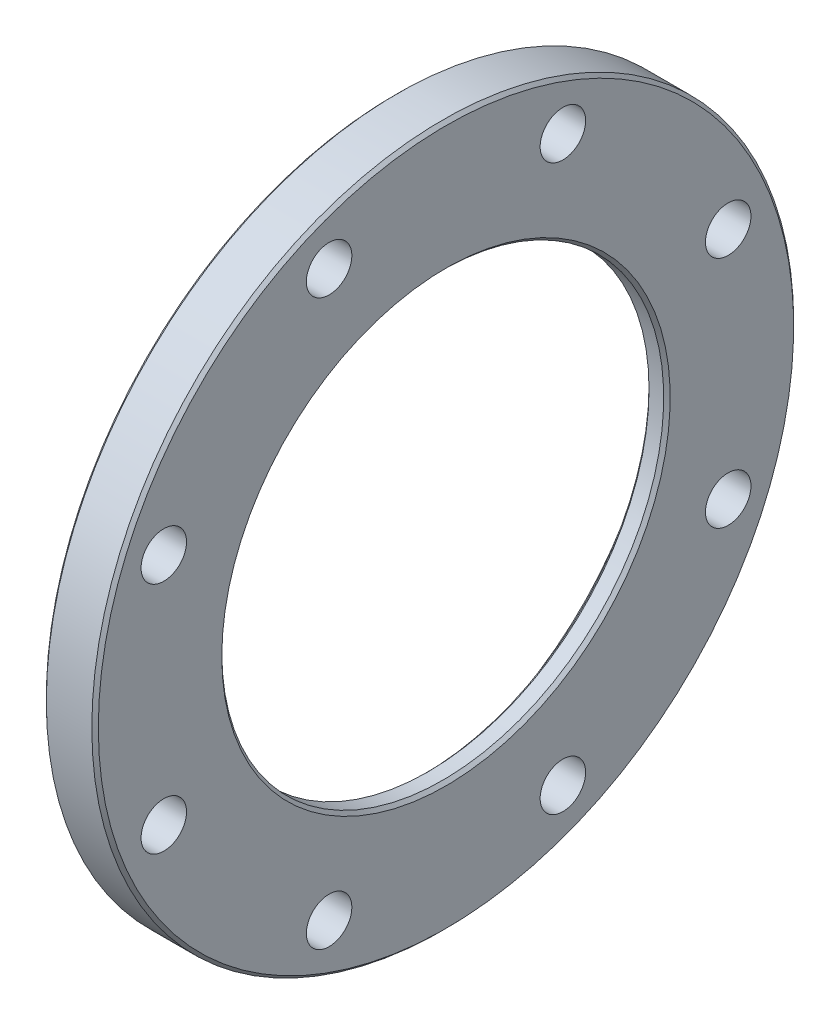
ISO-10303-21;
HEADER;
FILE_DESCRIPTION(('STEP AP214'),'2;1');
FILE_NAME('part.step','',(''),(''),'','','');
FILE_SCHEMA(('AUTOMOTIVE_DESIGN { 1 0 10303 214 1 1 1 1 }'));
ENDSEC;
DATA;
#1=APPLICATION_CONTEXT('core data for automotive mechanical design processes');
#2=APPLICATION_PROTOCOL_DEFINITION('international standard','automotive_design',2000,#1);
#3=PRODUCT_CONTEXT('',#1,'mechanical');
#4=PRODUCT('Part','Part','',(#3));
#5=PRODUCT_RELATED_PRODUCT_CATEGORY('part','',(#4));
#6=PRODUCT_DEFINITION_FORMATION('','',#4);
#7=PRODUCT_DEFINITION_CONTEXT('part definition',#1,'design');
#8=PRODUCT_DEFINITION('design','',#6,#7);
#9=PRODUCT_DEFINITION_SHAPE('','',#8);
#10=(LENGTH_UNIT() NAMED_UNIT(*) SI_UNIT(.MILLI.,.METRE.));
#11=(NAMED_UNIT(*) PLANE_ANGLE_UNIT() SI_UNIT($,.RADIAN.));
#12=(NAMED_UNIT(*) SI_UNIT($,.STERADIAN.) SOLID_ANGLE_UNIT());
#13=UNCERTAINTY_MEASURE_WITH_UNIT(LENGTH_MEASURE(1.E-05),#10,'distance_accuracy_value','');
#14=(GEOMETRIC_REPRESENTATION_CONTEXT(3) GLOBAL_UNCERTAINTY_ASSIGNED_CONTEXT((#13)) GLOBAL_UNIT_ASSIGNED_CONTEXT((#10,
#11,#12)) REPRESENTATION_CONTEXT('',''));
#15=CARTESIAN_POINT('',(0.,0.,0.));
#16=DIRECTION('',(0.,0.,1.));
#17=DIRECTION('',(1.,0.,0.));
#18=AXIS2_PLACEMENT_3D('',#15,#16,#17);
#19=CARTESIAN_POINT('',(25.4,0.,-107.95));
#20=DIRECTION('',(-1.,0.,0.));
#21=DIRECTION('',(0.,0.,1.));
#22=AXIS2_PLACEMENT_3D('',#19,#20,#21);
#23=PLANE('',#22);
#24=CARTESIAN_POINT('',(25.4,0.,0.));
#25=DIRECTION('',(-1.,0.,0.));
#26=DIRECTION('',(0.,0.,1.));
#27=AXIS2_PLACEMENT_3D('',#24,#25,#26);
#28=CIRCLE('',#27,109.5375);
#29=CARTESIAN_POINT('',(25.4,0.,109.5375));
#30=VERTEX_POINT('',#29);
#31=EDGE_CURVE('E42',#30,#30,#28,.T.);
#32=ORIENTED_EDGE('',*,*,#31,.T.);
#33=EDGE_LOOP('',(#32));
#34=FACE_BOUND('',#33,.T.);
#35=CARTESIAN_POINT('',(25.4,0.,0.));
#36=DIRECTION('',(-1.,0.,0.));
#37=DIRECTION('',(0.,0.,1.));
#38=AXIS2_PLACEMENT_3D('',#35,#36,#37);
#39=CIRCLE('',#38,169.8625);
#40=CARTESIAN_POINT('',(25.4,0.,169.8625));
#41=VERTEX_POINT('',#40);
#42=EDGE_CURVE('E46',#41,#41,#39,.F.);
#43=ORIENTED_EDGE('',*,*,#42,.T.);
#44=EDGE_LOOP('',(#43));
#45=FACE_BOUND('',#44,.T.);
#46=CARTESIAN_POINT('',(25.4,137.865923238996,57.1059351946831));
#47=DIRECTION('',(1.,0.,0.));
#48=DIRECTION('',(0.,0.,-1.));
#49=AXIS2_PLACEMENT_3D('',#46,#47,#48);
#50=CIRCLE('',#49,11.1125);
#51=CARTESIAN_POINT('',(25.4,137.865923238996,45.9934351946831));
#52=VERTEX_POINT('',#51);
#53=EDGE_CURVE('E74',#52,#52,#50,.T.);
#54=ORIENTED_EDGE('',*,*,#53,.F.);
#55=EDGE_LOOP('',(#54));
#56=FACE_BOUND('',#55,.T.);
#57=CARTESIAN_POINT('',(25.4,137.865923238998,-57.1059351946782));
#58=DIRECTION('',(1.,0.,0.));
#59=DIRECTION('',(0.,0.,-1.));
#60=AXIS2_PLACEMENT_3D('',#57,#58,#59);
#61=CIRCLE('',#60,11.1125);
#62=CARTESIAN_POINT('',(25.4,137.865923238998,-68.2184351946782));
#63=VERTEX_POINT('',#62);
#64=EDGE_CURVE('E73',#63,#63,#61,.T.);
#65=ORIENTED_EDGE('',*,*,#64,.F.);
#66=EDGE_LOOP('',(#65));
#67=FACE_BOUND('',#66,.T.);
#68=CARTESIAN_POINT('',(25.4,57.1059351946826,-137.865923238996));
#69=DIRECTION('',(1.,0.,0.));
#70=DIRECTION('',(0.,0.,-1.));
#71=AXIS2_PLACEMENT_3D('',#68,#69,#70);
#72=CIRCLE('',#71,11.1125);
#73=CARTESIAN_POINT('',(25.4,57.1059351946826,-148.978423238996));
#74=VERTEX_POINT('',#73);
#75=EDGE_CURVE('E78',#74,#74,#72,.T.);
#76=ORIENTED_EDGE('',*,*,#75,.F.);
#77=EDGE_LOOP('',(#76));
#78=FACE_BOUND('',#77,.T.);
#79=CARTESIAN_POINT('',(25.4,-57.1059351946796,-137.865923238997));
#80=DIRECTION('',(1.,0.,0.));
#81=DIRECTION('',(0.,0.,-1.));
#82=AXIS2_PLACEMENT_3D('',#79,#80,#81);
#83=CIRCLE('',#82,11.1125);
#84=CARTESIAN_POINT('',(25.4,-57.1059351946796,-148.978423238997));
#85=VERTEX_POINT('',#84);
#86=EDGE_CURVE('E82',#85,#85,#83,.T.);
#87=ORIENTED_EDGE('',*,*,#86,.F.);
#88=EDGE_LOOP('',(#87));
#89=FACE_BOUND('',#88,.T.);
#90=CARTESIAN_POINT('',(25.4,-137.865923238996,-57.1059351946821));
#91=DIRECTION('',(1.,0.,0.));
#92=DIRECTION('',(0.,0.,-1.));
#93=AXIS2_PLACEMENT_3D('',#90,#91,#92);
#94=CIRCLE('',#93,11.1125);
#95=CARTESIAN_POINT('',(25.4,-137.865923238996,-68.2184351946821));
#96=VERTEX_POINT('',#95);
#97=EDGE_CURVE('E106',#96,#96,#94,.T.);
#98=ORIENTED_EDGE('',*,*,#97,.F.);
#99=EDGE_LOOP('',(#98));
#100=FACE_BOUND('',#99,.T.);
#101=CARTESIAN_POINT('',(25.4,-137.865923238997,57.1059351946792));
#102=DIRECTION('',(1.,0.,0.));
#103=DIRECTION('',(0.,0.,-1.));
#104=AXIS2_PLACEMENT_3D('',#101,#102,#103);
#105=CIRCLE('',#104,11.1125);
#106=CARTESIAN_POINT('',(25.4,-137.865923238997,45.9934351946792));
#107=VERTEX_POINT('',#106);
#108=EDGE_CURVE('E100',#107,#107,#105,.T.);
#109=ORIENTED_EDGE('',*,*,#108,.F.);
#110=EDGE_LOOP('',(#109));
#111=FACE_BOUND('',#110,.T.);
#112=CARTESIAN_POINT('',(25.4,57.1059351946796,137.865923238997));
#113=DIRECTION('',(1.,0.,0.));
#114=DIRECTION('',(0.,0.,-1.));
#115=AXIS2_PLACEMENT_3D('',#112,#113,#114);
#116=CIRCLE('',#115,11.1125);
#117=CARTESIAN_POINT('',(25.4,57.1059351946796,126.753423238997));
#118=VERTEX_POINT('',#117);
#119=EDGE_CURVE('E88',#118,#118,#116,.T.);
#120=ORIENTED_EDGE('',*,*,#119,.F.);
#121=EDGE_LOOP('',(#120));
#122=FACE_BOUND('',#121,.T.);
#123=CARTESIAN_POINT('',(25.4,-57.1059351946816,137.865923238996));
#124=DIRECTION('',(1.,0.,0.));
#125=DIRECTION('',(0.,0.,-1.));
#126=AXIS2_PLACEMENT_3D('',#123,#124,#125);
#127=CIRCLE('',#126,11.1125);
#128=CARTESIAN_POINT('',(25.4,-57.1059351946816,126.753423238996));
#129=VERTEX_POINT('',#128);
#130=EDGE_CURVE('E94',#129,#129,#127,.T.);
#131=ORIENTED_EDGE('',*,*,#130,.F.);
#132=EDGE_LOOP('',(#131));
#133=FACE_BOUND('',#132,.T.);
#134=ADVANCED_FACE('F31',(#34,#45,#56,#67,#78,#89,#100,#111,#122,#133),#23,.F.);
#135=CARTESIAN_POINT('',(0.,0.,0.));
#136=DIRECTION('',(-1.,0.,0.));
#137=DIRECTION('',(0.,0.,1.));
#138=AXIS2_PLACEMENT_3D('',#135,#136,#137);
#139=CYLINDRICAL_SURFACE('',#138,171.45);
#140=CARTESIAN_POINT('',(1.58749999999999,0.,0.));
#141=DIRECTION('',(1.,0.,0.));
#142=DIRECTION('',(0.,0.,-1.));
#143=AXIS2_PLACEMENT_3D('',#140,#141,#142);
#144=CIRCLE('',#143,171.45);
#145=CARTESIAN_POINT('',(1.58749999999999,0.,-171.45));
#146=VERTEX_POINT('',#145);
#147=EDGE_CURVE('E10',#146,#146,#144,.T.);
#148=ORIENTED_EDGE('',*,*,#147,.T.);
#149=EDGE_LOOP('',(#148));
#150=FACE_BOUND('',#149,.T.);
#151=CARTESIAN_POINT('',(23.8125000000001,0.,0.));
#152=DIRECTION('',(-1.,0.,0.));
#153=DIRECTION('',(0.,0.,1.));
#154=AXIS2_PLACEMENT_3D('',#151,#152,#153);
#155=CIRCLE('',#154,171.45);
#156=CARTESIAN_POINT('',(23.8125000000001,0.,171.45));
#157=VERTEX_POINT('',#156);
#158=EDGE_CURVE('E38',#157,#157,#155,.T.);
#159=ORIENTED_EDGE('',*,*,#158,.T.);
#160=EDGE_LOOP('',(#159));
#161=FACE_BOUND('',#160,.T.);
#162=ADVANCED_FACE('F126',(#150,#161),#139,.T.);
#163=CARTESIAN_POINT('',(0.,0.,-171.45));
#164=DIRECTION('',(1.,0.,0.));
#165=DIRECTION('',(0.,0.,-1.));
#166=AXIS2_PLACEMENT_3D('',#163,#164,#165);
#167=PLANE('',#166);
#168=CARTESIAN_POINT('',(0.,0.,0.));
#169=DIRECTION('',(1.,0.,0.));
#170=DIRECTION('',(0.,0.,-1.));
#171=AXIS2_PLACEMENT_3D('',#168,#169,#170);
#172=CIRCLE('',#171,130.175);
#173=CARTESIAN_POINT('',(0.,0.,-130.175));
#174=VERTEX_POINT('',#173);
#175=EDGE_CURVE('E60',#174,#174,#172,.T.);
#176=ORIENTED_EDGE('',*,*,#175,.T.);
#177=EDGE_LOOP('',(#176));
#178=FACE_BOUND('',#177,.T.);
#179=CARTESIAN_POINT('',(0.,0.,0.));
#180=DIRECTION('',(1.,0.,0.));
#181=DIRECTION('',(0.,0.,-1.));
#182=AXIS2_PLACEMENT_3D('',#179,#180,#181);
#183=CIRCLE('',#182,169.8625);
#184=CARTESIAN_POINT('',(0.,0.,-169.8625));
#185=VERTEX_POINT('',#184);
#186=EDGE_CURVE('E63',#185,#185,#183,.F.);
#187=ORIENTED_EDGE('',*,*,#186,.T.);
#188=EDGE_LOOP('',(#187));
#189=FACE_BOUND('',#188,.T.);
#190=CARTESIAN_POINT('',(0.,137.865923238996,57.1059351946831));
#191=DIRECTION('',(1.,0.,0.));
#192=DIRECTION('',(0.,0.,-1.));
#193=AXIS2_PLACEMENT_3D('',#190,#191,#192);
#194=CIRCLE('',#193,11.1125);
#195=CARTESIAN_POINT('',(0.,137.865923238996,45.9934351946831));
#196=VERTEX_POINT('',#195);
#197=EDGE_CURVE('E70',#196,#196,#194,.T.);
#198=ORIENTED_EDGE('',*,*,#197,.T.);
#199=EDGE_LOOP('',(#198));
#200=FACE_BOUND('',#199,.T.);
#201=CARTESIAN_POINT('',(0.,137.865923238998,-57.1059351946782));
#202=DIRECTION('',(1.,0.,0.));
#203=DIRECTION('',(0.,0.,-1.));
#204=AXIS2_PLACEMENT_3D('',#201,#202,#203);
#205=CIRCLE('',#204,11.1125);
#206=CARTESIAN_POINT('',(0.,137.865923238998,-68.2184351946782));
#207=VERTEX_POINT('',#206);
#208=EDGE_CURVE('E75',#207,#207,#205,.T.);
#209=ORIENTED_EDGE('',*,*,#208,.T.);
#210=EDGE_LOOP('',(#209));
#211=FACE_BOUND('',#210,.T.);
#212=CARTESIAN_POINT('',(0.,57.1059351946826,-137.865923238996));
#213=DIRECTION('',(1.,0.,0.));
#214=DIRECTION('',(0.,0.,-1.));
#215=AXIS2_PLACEMENT_3D('',#212,#213,#214);
#216=CIRCLE('',#215,11.1125);
#217=CARTESIAN_POINT('',(0.,57.1059351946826,-148.978423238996));
#218=VERTEX_POINT('',#217);
#219=EDGE_CURVE('E79',#218,#218,#216,.T.);
#220=ORIENTED_EDGE('',*,*,#219,.T.);
#221=EDGE_LOOP('',(#220));
#222=FACE_BOUND('',#221,.T.);
#223=CARTESIAN_POINT('',(0.,-57.1059351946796,-137.865923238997));
#224=DIRECTION('',(1.,0.,0.));
#225=DIRECTION('',(0.,0.,-1.));
#226=AXIS2_PLACEMENT_3D('',#223,#224,#225);
#227=CIRCLE('',#226,11.1125);
#228=CARTESIAN_POINT('',(0.,-57.1059351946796,-148.978423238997));
#229=VERTEX_POINT('',#228);
#230=EDGE_CURVE('E109',#229,#229,#227,.T.);
#231=ORIENTED_EDGE('',*,*,#230,.T.);
#232=EDGE_LOOP('',(#231));
#233=FACE_BOUND('',#232,.T.);
#234=CARTESIAN_POINT('',(0.,-137.865923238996,-57.1059351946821));
#235=DIRECTION('',(1.,0.,0.));
#236=DIRECTION('',(0.,0.,-1.));
#237=AXIS2_PLACEMENT_3D('',#234,#235,#236);
#238=CIRCLE('',#237,11.1125);
#239=CARTESIAN_POINT('',(0.,-137.865923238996,-68.2184351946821));
#240=VERTEX_POINT('',#239);
#241=EDGE_CURVE('E103',#240,#240,#238,.T.);
#242=ORIENTED_EDGE('',*,*,#241,.T.);
#243=EDGE_LOOP('',(#242));
#244=FACE_BOUND('',#243,.T.);
#245=CARTESIAN_POINT('',(0.,-137.865923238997,57.1059351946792));
#246=DIRECTION('',(1.,0.,0.));
#247=DIRECTION('',(0.,0.,-1.));
#248=AXIS2_PLACEMENT_3D('',#245,#246,#247);
#249=CIRCLE('',#248,11.1125);
#250=CARTESIAN_POINT('',(0.,-137.865923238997,45.9934351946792));
#251=VERTEX_POINT('',#250);
#252=EDGE_CURVE('E97',#251,#251,#249,.T.);
#253=ORIENTED_EDGE('',*,*,#252,.T.);
#254=EDGE_LOOP('',(#253));
#255=FACE_BOUND('',#254,.T.);
#256=CARTESIAN_POINT('',(0.,-57.1059351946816,137.865923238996));
#257=DIRECTION('',(1.,0.,0.));
#258=DIRECTION('',(0.,0.,-1.));
#259=AXIS2_PLACEMENT_3D('',#256,#257,#258);
#260=CIRCLE('',#259,11.1125);
#261=CARTESIAN_POINT('',(0.,-57.1059351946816,126.753423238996));
#262=VERTEX_POINT('',#261);
#263=EDGE_CURVE('E91',#262,#262,#260,.T.);
#264=ORIENTED_EDGE('',*,*,#263,.T.);
#265=EDGE_LOOP('',(#264));
#266=FACE_BOUND('',#265,.T.);
#267=CARTESIAN_POINT('',(0.,57.1059351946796,137.865923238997));
#268=DIRECTION('',(1.,0.,0.));
#269=DIRECTION('',(0.,0.,-1.));
#270=AXIS2_PLACEMENT_3D('',#267,#268,#269);
#271=CIRCLE('',#270,11.1125);
#272=CARTESIAN_POINT('',(0.,57.1059351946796,126.753423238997));
#273=VERTEX_POINT('',#272);
#274=EDGE_CURVE('E85',#273,#273,#271,.T.);
#275=ORIENTED_EDGE('',*,*,#274,.T.);
#276=EDGE_LOOP('',(#275));
#277=FACE_BOUND('',#276,.T.);
#278=ADVANCED_FACE('F151',(#178,#189,#200,#211,#222,#233,#244,#255,#266,#277),#167,.F.);
#279=CARTESIAN_POINT('',(0.,0.,0.));
#280=DIRECTION('',(-1.,0.,0.));
#281=DIRECTION('',(0.,0.,1.));
#282=AXIS2_PLACEMENT_3D('',#279,#280,#281);
#283=CYLINDRICAL_SURFACE('',#282,128.5875);
#284=CARTESIAN_POINT('',(1.58750000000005,0.,0.));
#285=DIRECTION('',(1.,0.,0.));
#286=DIRECTION('',(0.,0.,-1.));
#287=AXIS2_PLACEMENT_3D('',#284,#285,#286);
#288=CIRCLE('',#287,128.5875);
#289=CARTESIAN_POINT('',(1.58750000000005,0.,-128.5875));
#290=VERTEX_POINT('',#289);
#291=EDGE_CURVE('E66',#290,#290,#288,.F.);
#292=ORIENTED_EDGE('',*,*,#291,.T.);
#293=EDGE_LOOP('',(#292));
#294=FACE_BOUND('',#293,.T.);
#295=CARTESIAN_POINT('',(15.0622,0.,0.));
#296=DIRECTION('',(-1.,0.,0.));
#297=DIRECTION('',(0.,0.,1.));
#298=AXIS2_PLACEMENT_3D('',#295,#296,#297);
#299=CIRCLE('',#298,128.5875);
#300=CARTESIAN_POINT('',(15.0622,0.,128.5875));
#301=VERTEX_POINT('',#300);
#302=EDGE_CURVE('E69',#301,#301,#299,.T.);
#303=ORIENTED_EDGE('',*,*,#302,.F.);
#304=EDGE_LOOP('',(#303));
#305=FACE_BOUND('',#304,.T.);
#306=ADVANCED_FACE('F154',(#294,#305),#283,.F.);
#307=CARTESIAN_POINT('',(15.0622,0.,-128.5875));
#308=DIRECTION('',(1.,0.,0.));
#309=DIRECTION('',(0.,0.,-1.));
#310=AXIS2_PLACEMENT_3D('',#307,#308,#309);
#311=PLANE('',#310);
#312=CARTESIAN_POINT('',(15.0622,0.,0.));
#313=DIRECTION('',(1.,0.,0.));
#314=DIRECTION('',(0.,0.,-1.));
#315=AXIS2_PLACEMENT_3D('',#312,#313,#314);
#316=CIRCLE('',#315,109.5375);
#317=CARTESIAN_POINT('',(15.0622,0.,-109.5375));
#318=VERTEX_POINT('',#317);
#319=EDGE_CURVE('E51',#318,#318,#316,.T.);
#320=ORIENTED_EDGE('',*,*,#319,.T.);
#321=EDGE_LOOP('',(#320));
#322=FACE_BOUND('',#321,.T.);
#323=ORIENTED_EDGE('',*,*,#302,.T.);
#324=EDGE_LOOP('',(#323));
#325=FACE_BOUND('',#324,.T.);
#326=ADVANCED_FACE('F166',(#322,#325),#311,.F.);
#327=CARTESIAN_POINT('',(0.,0.,0.));
#328=DIRECTION('',(-1.,0.,0.));
#329=DIRECTION('',(0.,0.,1.));
#330=AXIS2_PLACEMENT_3D('',#327,#328,#329);
#331=CYLINDRICAL_SURFACE('',#330,107.95);
#332=CARTESIAN_POINT('',(16.6496999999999,0.,0.));
#333=DIRECTION('',(1.,0.,0.));
#334=DIRECTION('',(0.,0.,-1.));
#335=AXIS2_PLACEMENT_3D('',#332,#333,#334);
#336=CIRCLE('',#335,107.95);
#337=CARTESIAN_POINT('',(16.6496999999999,0.,-107.95));
#338=VERTEX_POINT('',#337);
#339=EDGE_CURVE('E54',#338,#338,#336,.F.);
#340=ORIENTED_EDGE('',*,*,#339,.T.);
#341=EDGE_LOOP('',(#340));
#342=FACE_BOUND('',#341,.T.);
#343=CARTESIAN_POINT('',(23.8125,0.,0.));
#344=DIRECTION('',(-1.,0.,0.));
#345=DIRECTION('',(0.,0.,1.));
#346=AXIS2_PLACEMENT_3D('',#343,#344,#345);
#347=CIRCLE('',#346,107.95);
#348=CARTESIAN_POINT('',(23.8125,0.,107.95));
#349=VERTEX_POINT('',#348);
#350=EDGE_CURVE('E57',#349,#349,#347,.F.);
#351=ORIENTED_EDGE('',*,*,#350,.T.);
#352=EDGE_LOOP('',(#351));
#353=FACE_BOUND('',#352,.T.);
#354=ADVANCED_FACE('F160',(#342,#353),#331,.F.);
#355=CARTESIAN_POINT('',(25.4,57.1059351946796,137.865923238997));
#356=DIRECTION('',(1.,0.,0.));
#357=DIRECTION('',(0.,0.,-1.));
#358=AXIS2_PLACEMENT_3D('',#355,#356,#357);
#359=CYLINDRICAL_SURFACE('',#358,11.1125);
#360=ORIENTED_EDGE('',*,*,#119,.T.);
#361=EDGE_LOOP('',(#360));
#362=FACE_BOUND('',#361,.T.);
#363=ORIENTED_EDGE('',*,*,#274,.F.);
#364=EDGE_LOOP('',(#363));
#365=FACE_BOUND('',#364,.T.);
#366=ADVANCED_FACE('F147',(#362,#365),#359,.F.);
#367=CARTESIAN_POINT('',(25.4,-57.1059351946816,137.865923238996));
#368=DIRECTION('',(1.,0.,0.));
#369=DIRECTION('',(0.,0.,-1.));
#370=AXIS2_PLACEMENT_3D('',#367,#368,#369);
#371=CYLINDRICAL_SURFACE('',#370,11.1125);
#372=ORIENTED_EDGE('',*,*,#130,.T.);
#373=EDGE_LOOP('',(#372));
#374=FACE_BOUND('',#373,.T.);
#375=ORIENTED_EDGE('',*,*,#263,.F.);
#376=EDGE_LOOP('',(#375));
#377=FACE_BOUND('',#376,.T.);
#378=ADVANCED_FACE('F143',(#374,#377),#371,.F.);
#379=CARTESIAN_POINT('',(25.4,-137.865923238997,57.1059351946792));
#380=DIRECTION('',(1.,0.,0.));
#381=DIRECTION('',(0.,0.,-1.));
#382=AXIS2_PLACEMENT_3D('',#379,#380,#381);
#383=CYLINDRICAL_SURFACE('',#382,11.1125);
#384=ORIENTED_EDGE('',*,*,#108,.T.);
#385=EDGE_LOOP('',(#384));
#386=FACE_BOUND('',#385,.T.);
#387=ORIENTED_EDGE('',*,*,#252,.F.);
#388=EDGE_LOOP('',(#387));
#389=FACE_BOUND('',#388,.T.);
#390=ADVANCED_FACE('F146',(#386,#389),#383,.F.);
#391=CARTESIAN_POINT('',(25.4,-137.865923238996,-57.1059351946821));
#392=DIRECTION('',(1.,0.,0.));
#393=DIRECTION('',(0.,0.,-1.));
#394=AXIS2_PLACEMENT_3D('',#391,#392,#393);
#395=CYLINDRICAL_SURFACE('',#394,11.1125);
#396=ORIENTED_EDGE('',*,*,#97,.T.);
#397=EDGE_LOOP('',(#396));
#398=FACE_BOUND('',#397,.T.);
#399=ORIENTED_EDGE('',*,*,#241,.F.);
#400=EDGE_LOOP('',(#399));
#401=FACE_BOUND('',#400,.T.);
#402=ADVANCED_FACE('F214',(#398,#401),#395,.F.);
#403=CARTESIAN_POINT('',(25.4,-57.1059351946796,-137.865923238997));
#404=DIRECTION('',(1.,0.,0.));
#405=DIRECTION('',(0.,0.,-1.));
#406=AXIS2_PLACEMENT_3D('',#403,#404,#405);
#407=CYLINDRICAL_SURFACE('',#406,11.1125);
#408=ORIENTED_EDGE('',*,*,#86,.T.);
#409=EDGE_LOOP('',(#408));
#410=FACE_BOUND('',#409,.T.);
#411=ORIENTED_EDGE('',*,*,#230,.F.);
#412=EDGE_LOOP('',(#411));
#413=FACE_BOUND('',#412,.T.);
#414=ADVANCED_FACE('F219',(#410,#413),#407,.F.);
#415=CARTESIAN_POINT('',(25.4,57.1059351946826,-137.865923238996));
#416=DIRECTION('',(1.,0.,0.));
#417=DIRECTION('',(0.,0.,-1.));
#418=AXIS2_PLACEMENT_3D('',#415,#416,#417);
#419=CYLINDRICAL_SURFACE('',#418,11.1125);
#420=ORIENTED_EDGE('',*,*,#75,.T.);
#421=EDGE_LOOP('',(#420));
#422=FACE_BOUND('',#421,.T.);
#423=ORIENTED_EDGE('',*,*,#219,.F.);
#424=EDGE_LOOP('',(#423));
#425=FACE_BOUND('',#424,.T.);
#426=ADVANCED_FACE('F225',(#422,#425),#419,.F.);
#427=CARTESIAN_POINT('',(25.4,137.865923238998,-57.1059351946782));
#428=DIRECTION('',(1.,0.,0.));
#429=DIRECTION('',(0.,0.,-1.));
#430=AXIS2_PLACEMENT_3D('',#427,#428,#429);
#431=CYLINDRICAL_SURFACE('',#430,11.1125);
#432=ORIENTED_EDGE('',*,*,#64,.T.);
#433=EDGE_LOOP('',(#432));
#434=FACE_BOUND('',#433,.T.);
#435=ORIENTED_EDGE('',*,*,#208,.F.);
#436=EDGE_LOOP('',(#435));
#437=FACE_BOUND('',#436,.T.);
#438=ADVANCED_FACE('F229',(#434,#437),#431,.F.);
#439=CARTESIAN_POINT('',(25.4,137.865923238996,57.1059351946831));
#440=DIRECTION('',(1.,0.,0.));
#441=DIRECTION('',(0.,0.,-1.));
#442=AXIS2_PLACEMENT_3D('',#439,#440,#441);
#443=CYLINDRICAL_SURFACE('',#442,11.1125);
#444=ORIENTED_EDGE('',*,*,#53,.T.);
#445=EDGE_LOOP('',(#444));
#446=FACE_BOUND('',#445,.T.);
#447=ORIENTED_EDGE('',*,*,#197,.F.);
#448=EDGE_LOOP('',(#447));
#449=FACE_BOUND('',#448,.T.);
#450=ADVANCED_FACE('F121',(#446,#449),#443,.F.);
#451=CARTESIAN_POINT('',(1.58750000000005,0.,0.));
#452=DIRECTION('',(-1.,0.,0.));
#453=DIRECTION('',(0.,0.,1.));
#454=AXIS2_PLACEMENT_3D('',#451,#452,#453);
#455=CONICAL_SURFACE('',#454,128.5875,0.785398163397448);
#456=ORIENTED_EDGE('',*,*,#175,.F.);
#457=EDGE_LOOP('',(#456));
#458=FACE_BOUND('',#457,.T.);
#459=ORIENTED_EDGE('',*,*,#291,.F.);
#460=EDGE_LOOP('',(#459));
#461=FACE_BOUND('',#460,.T.);
#462=ADVANCED_FACE('F179',(#458,#461),#455,.F.);
#463=CARTESIAN_POINT('',(16.6496999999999,0.,0.));
#464=DIRECTION('',(-1.,0.,0.));
#465=DIRECTION('',(0.,0.,1.));
#466=AXIS2_PLACEMENT_3D('',#463,#464,#465);
#467=CONICAL_SURFACE('',#466,107.95,0.785398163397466);
#468=ORIENTED_EDGE('',*,*,#319,.F.);
#469=EDGE_LOOP('',(#468));
#470=FACE_BOUND('',#469,.T.);
#471=ORIENTED_EDGE('',*,*,#339,.F.);
#472=EDGE_LOOP('',(#471));
#473=FACE_BOUND('',#472,.T.);
#474=ADVANCED_FACE('F182',(#470,#473),#467,.F.);
#475=CARTESIAN_POINT('',(25.4,0.,0.));
#476=DIRECTION('',(1.,0.,0.));
#477=DIRECTION('',(0.,0.,-1.));
#478=AXIS2_PLACEMENT_3D('',#475,#476,#477);
#479=CONICAL_SURFACE('',#478,109.5375,0.785398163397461);
#480=ORIENTED_EDGE('',*,*,#350,.F.);
#481=EDGE_LOOP('',(#480));
#482=FACE_BOUND('',#481,.T.);
#483=ORIENTED_EDGE('',*,*,#31,.F.);
#484=EDGE_LOOP('',(#483));
#485=FACE_BOUND('',#484,.T.);
#486=ADVANCED_FACE('F186',(#482,#485),#479,.F.);
#487=CARTESIAN_POINT('',(0.,0.,0.));
#488=DIRECTION('',(1.,0.,0.));
#489=DIRECTION('',(0.,0.,-1.));
#490=AXIS2_PLACEMENT_3D('',#487,#488,#489);
#491=CONICAL_SURFACE('',#490,169.8625,0.78539816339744);
#492=ORIENTED_EDGE('',*,*,#147,.F.);
#493=EDGE_LOOP('',(#492));
#494=FACE_BOUND('',#493,.T.);
#495=ORIENTED_EDGE('',*,*,#186,.F.);
#496=EDGE_LOOP('',(#495));
#497=FACE_BOUND('',#496,.T.);
#498=ADVANCED_FACE('F189',(#494,#497),#491,.T.);
#499=CARTESIAN_POINT('',(23.8125000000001,0.,0.));
#500=DIRECTION('',(-1.,0.,0.));
#501=DIRECTION('',(0.,0.,1.));
#502=AXIS2_PLACEMENT_3D('',#499,#500,#501);
#503=CONICAL_SURFACE('',#502,171.45,0.785398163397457);
#504=ORIENTED_EDGE('',*,*,#42,.F.);
#505=EDGE_LOOP('',(#504));
#506=FACE_BOUND('',#505,.T.);
#507=ORIENTED_EDGE('',*,*,#158,.F.);
#508=EDGE_LOOP('',(#507));
#509=FACE_BOUND('',#508,.T.);
#510=ADVANCED_FACE('F33',(#506,#509),#503,.T.);
#511=CLOSED_SHELL('',(#134,#162,#278,#306,#326,#354,#366,#378,#390,#402,#414,#426,#438,#450,
#462,#474,#486,#498,#510));
#512=MANIFOLD_SOLID_BREP('B2',#511);
#513=ADVANCED_BREP_SHAPE_REPRESENTATION('',(#18,#512),#14);
#514=SHAPE_DEFINITION_REPRESENTATION(#9,#513);
ENDSEC;
END-ISO-10303-21;
